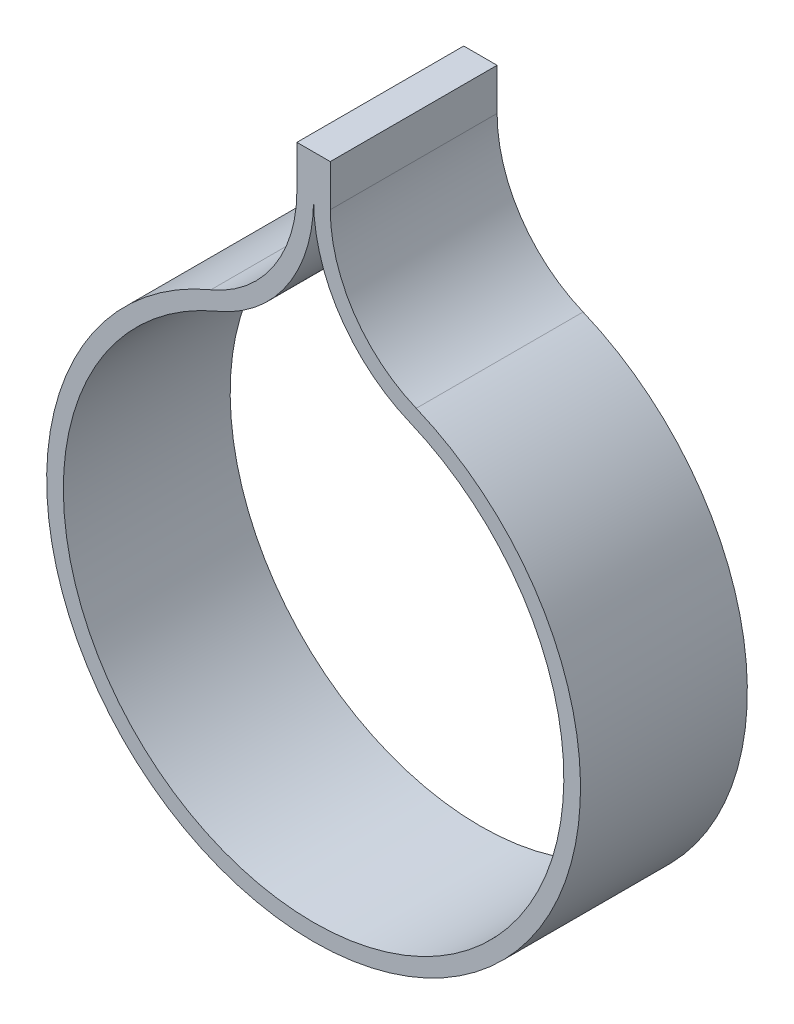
from build123d import *

# Parameters (mm, degrees)
BOSS_EXTRUDE1_DEPTH = 25.4


with BuildPart() as part:
    # Sketch1 → Boss-Extrude1 (new body)
    with BuildSketch(Plane.XY):
        with BuildLine():
            Line((-2.54, 57.15), (-2.54, 63.5))
            Line((-2.54, 63.5), (2.54, 63.5))
            Line((2.54, 63.5), (2.54, 57.15))
            ThreePointArc((2.54, 57.15), (6.112710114, 45.350140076), (15.630769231, 37.513846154))
            ThreePointArc((15.630769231, 37.513846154), (0, -40.64), (-15.630769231, 37.513846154))
            ThreePointArc((-15.630769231, 37.513846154), (-6.112710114, 45.350140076), (-2.54, 57.15))
        make_face()
        with BuildLine():
            ThreePointArc((-14.653846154, 35.169230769), (0, -38.1), (14.653846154, 35.169230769))
            ThreePointArc((14.653846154, 35.169230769), (3.999302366, 43.941201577), (0, 57.15))
            ThreePointArc((0, 57.15), (-3.999302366, 43.941201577), (-14.653846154, 35.169230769))
        make_face(mode=Mode.SUBTRACT)
    extrude(amount=BOSS_EXTRUDE1_DEPTH)


solid = part.part
